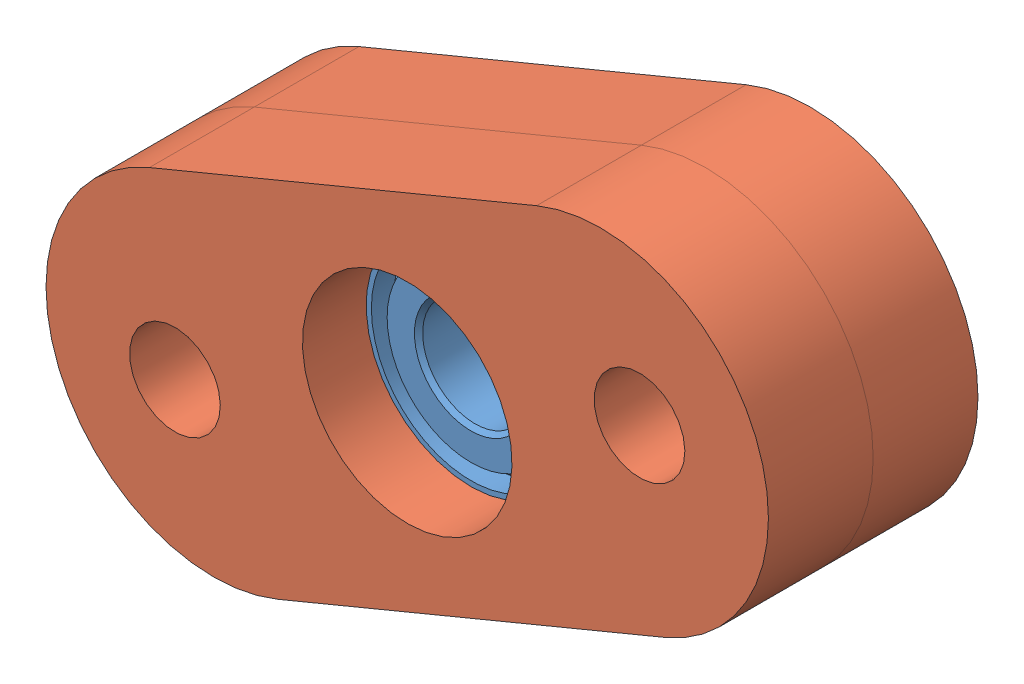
SolidWorks assembly Bearing subassembly.SLDASM, configuration Default (file format 15000). Lengths in mm.
Overall size (50.02 36.28 12.7).
3 component instances, 2 part files, 5 mates.
Components (placement in the parent):
- 60355K503_Ball Bearing-1: 60355K503_Ball Bearing.SLDPRT [60355K503] at (6.5463 8.5438 11.6817) size (15.88 15.88 4.98)
- bearing housing-1: bearing housing.SLDPRT [Default] at (6.5463 8.5438 18.0317) x (-0.923728 -0.383049 0) z (0 0 -1) size (45.72 20.32 6.35)
- bearing housing-2: bearing housing.SLDPRT [Default] at (6.5463 8.5438 5.3317) x (0.923728 0.383049 0) z (0 0 1) size (45.72 20.32 6.35)
Mates (geometry in assembly coordinates):
- Coincident1: coincident anti-aligned: plane of 60355K503_Ball Bearing-1 through (6.5463 16.2324 9.1925) normal (0 0 -1); plane of bearing housing-2 through (6.5463 8.5438 9.1925) normal (0 0 1)
- Concentric1: concentric aligned: cylinder of 60355K503_Ball Bearing-1 through (6.5463 8.5438 14.1709) axis (0 0 1) radius 7.9375; cylinder of bearing housing-2 through (6.5463 8.5438 9.1925) axis (0 0 1) radius 7.9375
- Coincident2: coincident anti-aligned: plane of 60355K503_Ball Bearing-1 through (6.5463 16.2324 14.1709) normal (0 0 1); plane of bearing housing-1 through (6.5463 8.5438 14.1709) normal (0 0 -1)
- Concentric2: concentric anti-aligned: cylinder of bearing housing-1 through (20.6239 14.3815 18.0317) axis (0 0 -1) radius 2.75; cylinder of bearing housing-2 through (20.6239 14.3815 5.3317) axis (0 0 1) radius 2.75
- Concentric3: concentric anti-aligned: circle of 60355K503_Ball Bearing-1; circle of bearing housing-1
